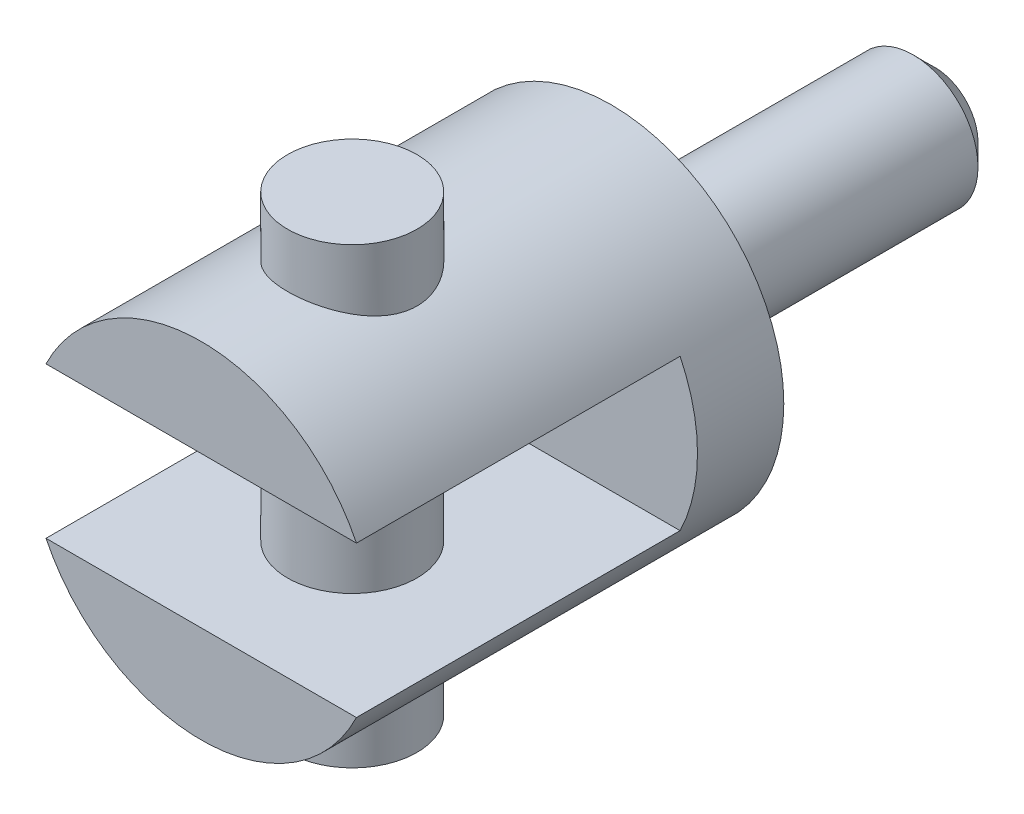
ISO-10303-21;
HEADER;
FILE_DESCRIPTION(('STEP AP214'),'2;1');
FILE_NAME('part.step','',(''),(''),'','','');
FILE_SCHEMA(('AUTOMOTIVE_DESIGN { 1 0 10303 214 1 1 1 1 }'));
ENDSEC;
DATA;
#1=APPLICATION_CONTEXT('core data for automotive mechanical design processes');
#2=APPLICATION_PROTOCOL_DEFINITION('international standard','automotive_design',2000,#1);
#3=PRODUCT_CONTEXT('',#1,'mechanical');
#4=PRODUCT('Part','Part','',(#3));
#5=PRODUCT_RELATED_PRODUCT_CATEGORY('part','',(#4));
#6=PRODUCT_DEFINITION_FORMATION('','',#4);
#7=PRODUCT_DEFINITION_CONTEXT('part definition',#1,'design');
#8=PRODUCT_DEFINITION('design','',#6,#7);
#9=PRODUCT_DEFINITION_SHAPE('','',#8);
#10=(LENGTH_UNIT() NAMED_UNIT(*) SI_UNIT(.MILLI.,.METRE.));
#11=(NAMED_UNIT(*) PLANE_ANGLE_UNIT() SI_UNIT($,.RADIAN.));
#12=(NAMED_UNIT(*) SI_UNIT($,.STERADIAN.) SOLID_ANGLE_UNIT());
#13=UNCERTAINTY_MEASURE_WITH_UNIT(LENGTH_MEASURE(1.E-05),#10,'distance_accuracy_value','');
#14=(GEOMETRIC_REPRESENTATION_CONTEXT(3) GLOBAL_UNCERTAINTY_ASSIGNED_CONTEXT((#13)) GLOBAL_UNIT_ASSIGNED_CONTEXT((#10,
#11,#12)) REPRESENTATION_CONTEXT('',''));
#15=CARTESIAN_POINT('',(0.,0.,0.));
#16=DIRECTION('',(0.,0.,1.));
#17=DIRECTION('',(1.,0.,0.));
#18=AXIS2_PLACEMENT_3D('',#15,#16,#17);
#19=CARTESIAN_POINT('',(0.,0.,19.));
#20=DIRECTION('',(0.,0.,1.));
#21=DIRECTION('',(1.,0.,0.));
#22=AXIS2_PLACEMENT_3D('',#19,#20,#21);
#23=PLANE('',#22);
#24=DIRECTION('',(1.,0.,0.));
#25=VECTOR('',#24,1.);
#26=CARTESIAN_POINT('',(0.,-3.5,19.));
#27=LINE('',#26,#25);
#28=CARTESIAN_POINT('',(-7.19374728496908,-3.5,19.));
#29=VERTEX_POINT('',#28);
#30=CARTESIAN_POINT('',(7.19374728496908,-3.5,19.));
#31=VERTEX_POINT('',#30);
#32=EDGE_CURVE('E37',#29,#31,#27,.T.);
#33=ORIENTED_EDGE('',*,*,#32,.F.);
#34=CARTESIAN_POINT('',(0.,0.,19.));
#35=DIRECTION('',(0.,0.,1.));
#36=DIRECTION('',(1.,0.,0.));
#37=AXIS2_PLACEMENT_3D('',#34,#35,#36);
#38=CIRCLE('',#37,8.);
#39=EDGE_CURVE('E86',#29,#31,#38,.T.);
#40=ORIENTED_EDGE('',*,*,#39,.T.);
#41=EDGE_LOOP('',(#33,#40));
#42=FACE_BOUND('',#41,.T.);
#43=ADVANCED_FACE('F14',(#42),#23,.T.);
#44=DIRECTION('',(-1.,0.,0.));
#45=VECTOR('',#44,1.);
#46=CARTESIAN_POINT('',(0.,3.5,19.));
#47=LINE('',#46,#45);
#48=CARTESIAN_POINT('',(7.19374728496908,3.5,19.));
#49=VERTEX_POINT('',#48);
#50=CARTESIAN_POINT('',(-7.19374728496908,3.5,19.));
#51=VERTEX_POINT('',#50);
#52=EDGE_CURVE('E56',#49,#51,#47,.T.);
#53=ORIENTED_EDGE('',*,*,#52,.F.);
#54=EDGE_CURVE('E85',#49,#51,#38,.T.);
#55=ORIENTED_EDGE('',*,*,#54,.T.);
#56=EDGE_LOOP('',(#53,#55));
#57=FACE_BOUND('',#56,.T.);
#58=ADVANCED_FACE('F150',(#57),#23,.T.);
#59=CARTESIAN_POINT('',(0.,0.,30.));
#60=DIRECTION('',(0.,0.,1.));
#61=DIRECTION('',(1.,0.,0.));
#62=AXIS2_PLACEMENT_3D('',#59,#60,#61);
#63=CYLINDRICAL_SURFACE('',#62,8.);
#64=CARTESIAN_POINT('',(0.,8.,9.));
#65=CARTESIAN_POINT('',(-0.162470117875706,8.00000434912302,8.99999419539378));
#66=CARTESIAN_POINT('',(-0.324900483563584,7.99500758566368,9.01323952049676));
#67=CARTESIAN_POINT('',(-0.644906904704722,7.97557392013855,9.06565639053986));
#68=CARTESIAN_POINT('',(-0.802483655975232,7.96113837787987,9.10482420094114));
#69=CARTESIAN_POINT('',(-1.10812156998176,7.92437664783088,9.20750600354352));
#70=CARTESIAN_POINT('',(-1.25620044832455,7.90206568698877,9.27097303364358));
#71=CARTESIAN_POINT('',(-1.53959862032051,7.85177535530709,9.42021282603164));
#72=CARTESIAN_POINT('',(-1.67491447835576,7.82379446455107,9.5059915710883));
#73=CARTESIAN_POINT('',(-1.93469283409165,7.76372493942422,9.70122506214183));
#74=CARTESIAN_POINT('',(-2.05854146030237,7.73152005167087,9.81146052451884));
#75=CARTESIAN_POINT('',(-2.28648842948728,7.66720441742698,10.0508208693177));
#76=CARTESIAN_POINT('',(-2.39058072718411,7.63509370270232,10.1799515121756));
#77=CARTESIAN_POINT('',(-2.57996404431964,7.5732494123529,10.4594349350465));
#78=CARTESIAN_POINT('',(-2.66438786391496,7.5436529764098,10.6104087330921));
#79=CARTESIAN_POINT('',(-2.80637292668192,7.49199720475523,10.9256967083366));
#80=CARTESIAN_POINT('',(-2.86394489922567,7.46993485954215,11.0900055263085));
#81=CARTESIAN_POINT('',(-2.94816862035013,7.43708825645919,11.4202334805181));
#82=CARTESIAN_POINT('',(-2.97599186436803,7.42587848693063,11.585810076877));
#83=CARTESIAN_POINT('',(-3.00359113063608,7.41476122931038,11.9196323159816));
#84=CARTESIAN_POINT('',(-3.00337873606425,7.41484907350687,12.0878768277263));
#85=CARTESIAN_POINT('',(-2.97580859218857,7.42595023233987,12.4115390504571));
#86=CARTESIAN_POINT('',(-2.95007617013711,7.43630937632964,12.5671218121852));
#87=CARTESIAN_POINT('',(-2.87488335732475,7.46569876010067,12.8715743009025));
#88=CARTESIAN_POINT('',(-2.82541939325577,7.48473030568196,13.020443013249));
#89=CARTESIAN_POINT('',(-2.70327497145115,7.52971404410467,13.3105541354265));
#90=CARTESIAN_POINT('',(-2.63017297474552,7.55579035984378,13.4515989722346));
#91=CARTESIAN_POINT('',(-2.46312147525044,7.61188420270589,13.71989147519));
#92=CARTESIAN_POINT('',(-2.36916477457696,7.64190308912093,13.8471343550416));
#93=CARTESIAN_POINT('',(-2.15563561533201,7.70496077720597,14.0932073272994));
#94=CARTESIAN_POINT('',(-2.03476597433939,7.73806694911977,14.2108972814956));
#95=CARTESIAN_POINT('',(-1.77462518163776,7.80183456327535,14.4246759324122));
#96=CARTESIAN_POINT('',(-1.63535120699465,7.83249562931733,14.5207613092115));
#97=CARTESIAN_POINT('',(-1.33944687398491,7.88852789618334,14.6898607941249));
#98=CARTESIAN_POINT('',(-1.18258142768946,7.91380996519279,14.7624951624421));
#99=CARTESIAN_POINT('',(-0.857673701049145,7.95557436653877,14.8799652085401));
#100=CARTESIAN_POINT('',(-0.689636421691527,7.97206060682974,14.9248132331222));
#101=CARTESIAN_POINT('',(-0.356750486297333,7.99368886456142,14.9832455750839));
#102=CARTESIAN_POINT('',(-0.192207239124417,7.99938738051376,14.998365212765));
#103=CARTESIAN_POINT('',(0.137144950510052,8.00051787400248,15.0013821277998));
#104=CARTESIAN_POINT('',(0.301953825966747,7.99595212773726,14.9892854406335));
#105=CARTESIAN_POINT('',(0.62052409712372,7.97743419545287,14.9393799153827));
#106=CARTESIAN_POINT('',(0.774466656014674,7.9638494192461,14.9025769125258));
#107=CARTESIAN_POINT('',(1.07388350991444,7.92902954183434,14.8056278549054));
#108=CARTESIAN_POINT('',(1.21935670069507,7.9077934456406,14.7454787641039));
#109=CARTESIAN_POINT('',(1.50249553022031,7.85899248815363,14.601627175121));
#110=CARTESIAN_POINT('',(1.63980616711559,7.83126000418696,14.5172845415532));
#111=CARTESIAN_POINT('',(1.89878542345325,7.77253343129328,14.3281637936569));
#112=CARTESIAN_POINT('',(2.0204482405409,7.74153814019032,14.2233781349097));
#113=CARTESIAN_POINT('',(2.25206159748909,7.67746658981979,13.9891917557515));
#114=CARTESIAN_POINT('',(2.36092308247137,7.64437393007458,13.8587156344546));
#115=CARTESIAN_POINT('',(2.55542100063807,7.58157631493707,13.5806972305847));
#116=CARTESIAN_POINT('',(2.64105534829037,7.55187166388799,13.433153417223));
#117=CARTESIAN_POINT('',(2.78675547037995,7.49933659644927,13.1239680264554));
#118=CARTESIAN_POINT('',(2.84671370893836,7.47653520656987,12.9622705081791));
#119=CARTESIAN_POINT('',(2.93815766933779,7.4410806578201,12.6299804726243));
#120=CARTESIAN_POINT('',(2.9696610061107,7.42842122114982,12.4593935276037));
#121=CARTESIAN_POINT('',(3.00172694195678,7.41551789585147,12.1259676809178));
#122=CARTESIAN_POINT('',(3.00414662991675,7.41452889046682,11.9633347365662));
#123=CARTESIAN_POINT('',(2.98273431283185,7.42316825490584,11.6401093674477));
#124=CARTESIAN_POINT('',(2.95890479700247,7.43279561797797,11.4795167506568));
#125=CARTESIAN_POINT('',(2.88711631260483,7.46096283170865,11.1699055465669));
#126=CARTESIAN_POINT('',(2.83991596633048,7.47922170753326,11.0206833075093));
#127=CARTESIAN_POINT('',(2.72339393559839,7.5224309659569,10.7321889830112));
#128=CARTESIAN_POINT('',(2.65406665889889,7.5473830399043,10.5929194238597));
#129=CARTESIAN_POINT('',(2.49104151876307,7.60279447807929,10.3203464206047));
#130=CARTESIAN_POINT('',(2.3962566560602,7.63347396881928,10.1877384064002));
#131=CARTESIAN_POINT('',(2.18668971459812,7.69612493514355,9.93971687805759));
#132=CARTESIAN_POINT('',(2.07190128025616,7.72809681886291,9.82430885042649));
#133=CARTESIAN_POINT('',(1.81816079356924,7.79180849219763,9.60759608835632));
#134=CARTESIAN_POINT('',(1.67823728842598,7.82344209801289,9.50739249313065));
#135=CARTESIAN_POINT('',(1.38242644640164,7.88109028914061,9.33195468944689));
#136=CARTESIAN_POINT('',(1.22653786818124,7.90710443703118,9.25672242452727));
#137=CARTESIAN_POINT('',(0.895998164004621,7.9514858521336,9.13124634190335));
#138=CARTESIAN_POINT('',(0.720826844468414,7.96947314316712,9.08222587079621));
#139=CARTESIAN_POINT('',(0.363751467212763,7.99372484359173,9.01661408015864));
#140=CARTESIAN_POINT('',(0.181850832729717,7.99999513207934,9.00000649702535));
#141=CARTESIAN_POINT('',(0.,8.,9.));
#142=B_SPLINE_CURVE_WITH_KNOTS('',3,(#64,#65,#66,#67,#68,#69,#70,#71,#72,#73,#74,#75,#76,#77,
#78,#79,#80,#81,#82,#83,#84,#85,#86,#87,#88,#89,#90,#91,#92,#93,#94,#95,#96,#97,#98,#99,#100,
#101,#102,#103,#104,#105,#106,#107,#108,#109,#110,#111,#112,#113,#114,#115,#116,#117,#118,#119,
#120,#121,#122,#123,#124,#125,#126,#127,#128,#129,#130,#131,#132,#133,#134,#135,#136,#137,#138,
#139,#140,#141),.UNSPECIFIED.,.T.,.F.,(4,2,2,2,2,2,2,2,2,2,2,2,2,2,2,2,2,2,2,2,2,2,2,2,2,2,2,2,
2,2,2,2,2,2,2,2,2,2,4),(0.,0.486739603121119,0.973409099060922,1.45914273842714,
1.94500675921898,2.44947237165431,2.95409209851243,3.47793349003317,4.00156538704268,
4.50371748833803,5.00566212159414,5.47756690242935,5.94954276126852,6.4304481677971,
6.91151981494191,7.42492306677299,7.93840515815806,8.45982750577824,8.98101799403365,
9.47450039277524,9.96787336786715,10.4422887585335,10.9167658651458,11.4051844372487,
11.8937836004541,12.4107303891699,12.9277235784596,13.4468613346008,13.9656774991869,
14.4511752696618,14.9366270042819,15.4072628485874,15.8780177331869,16.3734494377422,
16.869038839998,17.3914465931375,17.9138949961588,18.4589703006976,19.0037720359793),.UNSPECIFIED.);
#143=CARTESIAN_POINT('',(0.,8.,9.));
#144=VERTEX_POINT('',#143);
#145=EDGE_CURVE('E98',#144,#144,#142,.T.);
#146=ORIENTED_EDGE('',*,*,#145,.F.);
#147=EDGE_LOOP('',(#146));
#148=FACE_BOUND('',#147,.T.);
#149=CARTESIAN_POINT('',(0.,-8.,9.));
#150=CARTESIAN_POINT('',(0.162470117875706,-8.00000434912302,8.99999419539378));
#151=CARTESIAN_POINT('',(0.324900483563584,-7.99500758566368,9.01323952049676));
#152=CARTESIAN_POINT('',(0.644906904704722,-7.97557392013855,9.06565639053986));
#153=CARTESIAN_POINT('',(0.802483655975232,-7.96113837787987,9.10482420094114));
#154=CARTESIAN_POINT('',(1.10812156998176,-7.92437664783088,9.20750600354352));
#155=CARTESIAN_POINT('',(1.25620044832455,-7.90206568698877,9.27097303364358));
#156=CARTESIAN_POINT('',(1.53959862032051,-7.85177535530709,9.42021282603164));
#157=CARTESIAN_POINT('',(1.67491447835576,-7.82379446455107,9.5059915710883));
#158=CARTESIAN_POINT('',(1.93469283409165,-7.76372493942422,9.70122506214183));
#159=CARTESIAN_POINT('',(2.05854146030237,-7.73152005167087,9.81146052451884));
#160=CARTESIAN_POINT('',(2.28648842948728,-7.66720441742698,10.0508208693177));
#161=CARTESIAN_POINT('',(2.39058072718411,-7.63509370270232,10.1799515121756));
#162=CARTESIAN_POINT('',(2.57996404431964,-7.5732494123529,10.4594349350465));
#163=CARTESIAN_POINT('',(2.66438786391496,-7.5436529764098,10.6104087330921));
#164=CARTESIAN_POINT('',(2.80637292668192,-7.49199720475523,10.9256967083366));
#165=CARTESIAN_POINT('',(2.86394489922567,-7.46993485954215,11.0900055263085));
#166=CARTESIAN_POINT('',(2.94816862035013,-7.43708825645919,11.4202334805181));
#167=CARTESIAN_POINT('',(2.97599186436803,-7.42587848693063,11.585810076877));
#168=CARTESIAN_POINT('',(3.00359113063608,-7.41476122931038,11.9196323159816));
#169=CARTESIAN_POINT('',(3.00337873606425,-7.41484907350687,12.0878768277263));
#170=CARTESIAN_POINT('',(2.97580859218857,-7.42595023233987,12.4115390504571));
#171=CARTESIAN_POINT('',(2.95007617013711,-7.43630937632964,12.5671218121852));
#172=CARTESIAN_POINT('',(2.87488335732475,-7.46569876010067,12.8715743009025));
#173=CARTESIAN_POINT('',(2.82541939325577,-7.48473030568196,13.020443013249));
#174=CARTESIAN_POINT('',(2.70327497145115,-7.52971404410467,13.3105541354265));
#175=CARTESIAN_POINT('',(2.63017297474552,-7.55579035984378,13.4515989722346));
#176=CARTESIAN_POINT('',(2.46312147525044,-7.61188420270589,13.71989147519));
#177=CARTESIAN_POINT('',(2.36916477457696,-7.64190308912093,13.8471343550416));
#178=CARTESIAN_POINT('',(2.15563561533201,-7.70496077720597,14.0932073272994));
#179=CARTESIAN_POINT('',(2.03476597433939,-7.73806694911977,14.2108972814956));
#180=CARTESIAN_POINT('',(1.77462518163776,-7.80183456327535,14.4246759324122));
#181=CARTESIAN_POINT('',(1.63535120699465,-7.83249562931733,14.5207613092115));
#182=CARTESIAN_POINT('',(1.33944687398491,-7.88852789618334,14.6898607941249));
#183=CARTESIAN_POINT('',(1.18258142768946,-7.91380996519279,14.7624951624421));
#184=CARTESIAN_POINT('',(0.857673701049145,-7.95557436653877,14.8799652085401));
#185=CARTESIAN_POINT('',(0.689636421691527,-7.97206060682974,14.9248132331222));
#186=CARTESIAN_POINT('',(0.356750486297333,-7.99368886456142,14.9832455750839));
#187=CARTESIAN_POINT('',(0.192207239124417,-7.99938738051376,14.998365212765));
#188=CARTESIAN_POINT('',(-0.137144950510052,-8.00051787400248,15.0013821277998));
#189=CARTESIAN_POINT('',(-0.301953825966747,-7.99595212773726,14.9892854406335));
#190=CARTESIAN_POINT('',(-0.62052409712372,-7.97743419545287,14.9393799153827));
#191=CARTESIAN_POINT('',(-0.774466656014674,-7.9638494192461,14.9025769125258));
#192=CARTESIAN_POINT('',(-1.07388350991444,-7.92902954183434,14.8056278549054));
#193=CARTESIAN_POINT('',(-1.21935670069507,-7.9077934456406,14.7454787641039));
#194=CARTESIAN_POINT('',(-1.50249553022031,-7.85899248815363,14.601627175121));
#195=CARTESIAN_POINT('',(-1.63980616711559,-7.83126000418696,14.5172845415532));
#196=CARTESIAN_POINT('',(-1.89878542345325,-7.77253343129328,14.3281637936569));
#197=CARTESIAN_POINT('',(-2.0204482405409,-7.74153814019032,14.2233781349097));
#198=CARTESIAN_POINT('',(-2.25206159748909,-7.67746658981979,13.9891917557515));
#199=CARTESIAN_POINT('',(-2.36092308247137,-7.64437393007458,13.8587156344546));
#200=CARTESIAN_POINT('',(-2.55542100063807,-7.58157631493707,13.5806972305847));
#201=CARTESIAN_POINT('',(-2.64105534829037,-7.55187166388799,13.433153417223));
#202=CARTESIAN_POINT('',(-2.78675547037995,-7.49933659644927,13.1239680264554));
#203=CARTESIAN_POINT('',(-2.84671370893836,-7.47653520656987,12.9622705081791));
#204=CARTESIAN_POINT('',(-2.93815766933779,-7.4410806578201,12.6299804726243));
#205=CARTESIAN_POINT('',(-2.9696610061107,-7.42842122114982,12.4593935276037));
#206=CARTESIAN_POINT('',(-3.00172694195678,-7.41551789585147,12.1259676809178));
#207=CARTESIAN_POINT('',(-3.00414662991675,-7.41452889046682,11.9633347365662));
#208=CARTESIAN_POINT('',(-2.98273431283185,-7.42316825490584,11.6401093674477));
#209=CARTESIAN_POINT('',(-2.95890479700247,-7.43279561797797,11.4795167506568));
#210=CARTESIAN_POINT('',(-2.88711631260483,-7.46096283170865,11.1699055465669));
#211=CARTESIAN_POINT('',(-2.83991596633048,-7.47922170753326,11.0206833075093));
#212=CARTESIAN_POINT('',(-2.72339393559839,-7.5224309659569,10.7321889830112));
#213=CARTESIAN_POINT('',(-2.65406665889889,-7.5473830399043,10.5929194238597));
#214=CARTESIAN_POINT('',(-2.49104151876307,-7.60279447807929,10.3203464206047));
#215=CARTESIAN_POINT('',(-2.3962566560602,-7.63347396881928,10.1877384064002));
#216=CARTESIAN_POINT('',(-2.18668971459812,-7.69612493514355,9.93971687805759));
#217=CARTESIAN_POINT('',(-2.07190128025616,-7.72809681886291,9.82430885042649));
#218=CARTESIAN_POINT('',(-1.81816079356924,-7.79180849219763,9.60759608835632));
#219=CARTESIAN_POINT('',(-1.67823728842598,-7.82344209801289,9.50739249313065));
#220=CARTESIAN_POINT('',(-1.38242644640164,-7.88109028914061,9.33195468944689));
#221=CARTESIAN_POINT('',(-1.22653786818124,-7.90710443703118,9.25672242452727));
#222=CARTESIAN_POINT('',(-0.895998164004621,-7.9514858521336,9.13124634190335));
#223=CARTESIAN_POINT('',(-0.720826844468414,-7.96947314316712,9.08222587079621));
#224=CARTESIAN_POINT('',(-0.363751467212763,-7.99372484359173,9.01661408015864));
#225=CARTESIAN_POINT('',(-0.181850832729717,-7.99999513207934,9.00000649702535));
#226=CARTESIAN_POINT('',(0.,-8.,9.));
#227=B_SPLINE_CURVE_WITH_KNOTS('',3,(#149,#150,#151,#152,#153,#154,#155,#156,#157,#158,#159,
#160,#161,#162,#163,#164,#165,#166,#167,#168,#169,#170,#171,#172,#173,#174,#175,#176,#177,#178,
#179,#180,#181,#182,#183,#184,#185,#186,#187,#188,#189,#190,#191,#192,#193,#194,#195,#196,#197,
#198,#199,#200,#201,#202,#203,#204,#205,#206,#207,#208,#209,#210,#211,#212,#213,#214,#215,#216,
#217,#218,#219,#220,#221,#222,#223,#224,#225,#226),.UNSPECIFIED.,.T.,.F.,(4,2,2,2,2,2,2,2,2,2,2,
2,2,2,2,2,2,2,2,2,2,2,2,2,2,2,2,2,2,2,2,2,2,2,2,2,2,2,4),(0.,0.486739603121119,
0.973409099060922,1.45914273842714,1.94500675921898,2.44947237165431,2.95409209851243,
3.47793349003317,4.00156538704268,4.50371748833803,5.00566212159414,5.47756690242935,
5.94954276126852,6.4304481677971,6.91151981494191,7.42492306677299,7.93840515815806,
8.45982750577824,8.98101799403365,9.47450039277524,9.96787336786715,10.4422887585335,
10.9167658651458,11.4051844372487,11.8937836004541,12.4107303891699,12.9277235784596,
13.4468613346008,13.9656774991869,14.4511752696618,14.9366270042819,15.4072628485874,
15.8780177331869,16.3734494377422,16.869038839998,17.3914465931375,17.9138949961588,
18.4589703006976,19.0037720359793),.UNSPECIFIED.);
#228=CARTESIAN_POINT('',(0.,-8.,9.));
#229=VERTEX_POINT('',#228);
#230=EDGE_CURVE('E80',#229,#229,#227,.T.);
#231=ORIENTED_EDGE('',*,*,#230,.F.);
#232=EDGE_LOOP('',(#231));
#233=FACE_BOUND('',#232,.T.);
#234=DIRECTION('',(0.,0.,1.));
#235=VECTOR('',#234,1.);
#236=CARTESIAN_POINT('',(-7.19374728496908,-3.5,30.));
#237=LINE('',#236,#235);
#238=CARTESIAN_POINT('',(-7.19374728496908,-3.5,4.));
#239=VERTEX_POINT('',#238);
#240=EDGE_CURVE('E78',#239,#29,#237,.T.);
#241=ORIENTED_EDGE('',*,*,#240,.F.);
#242=CARTESIAN_POINT('',(0.,0.,4.));
#243=DIRECTION('',(0.,0.,-1.));
#244=DIRECTION('',(-1.,0.,0.));
#245=AXIS2_PLACEMENT_3D('',#242,#243,#244);
#246=CIRCLE('',#245,8.);
#247=CARTESIAN_POINT('',(-7.19374728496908,3.5,4.));
#248=VERTEX_POINT('',#247);
#249=EDGE_CURVE('E61',#248,#239,#246,.F.);
#250=ORIENTED_EDGE('',*,*,#249,.F.);
#251=DIRECTION('',(0.,0.,1.));
#252=VECTOR('',#251,1.);
#253=CARTESIAN_POINT('',(-7.19374728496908,3.5,30.));
#254=LINE('',#253,#252);
#255=EDGE_CURVE('E53',#51,#248,#254,.F.);
#256=ORIENTED_EDGE('',*,*,#255,.F.);
#257=ORIENTED_EDGE('',*,*,#54,.F.);
#258=DIRECTION('',(0.,0.,1.));
#259=VECTOR('',#258,1.);
#260=CARTESIAN_POINT('',(7.19374728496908,3.5,30.));
#261=LINE('',#260,#259);
#262=CARTESIAN_POINT('',(7.19374728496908,3.5,4.));
#263=VERTEX_POINT('',#262);
#264=EDGE_CURVE('E84',#263,#49,#261,.T.);
#265=ORIENTED_EDGE('',*,*,#264,.F.);
#266=CARTESIAN_POINT('',(7.19374728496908,-3.5,4.));
#267=VERTEX_POINT('',#266);
#268=EDGE_CURVE('E69',#267,#263,#246,.F.);
#269=ORIENTED_EDGE('',*,*,#268,.F.);
#270=DIRECTION('',(0.,0.,1.));
#271=VECTOR('',#270,1.);
#272=CARTESIAN_POINT('',(7.19374728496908,-3.5,30.));
#273=LINE('',#272,#271);
#274=EDGE_CURVE('E62',#31,#267,#273,.F.);
#275=ORIENTED_EDGE('',*,*,#274,.F.);
#276=ORIENTED_EDGE('',*,*,#39,.F.);
#277=EDGE_LOOP('',(#241,#250,#256,#257,#265,#269,#275,#276));
#278=FACE_BOUND('',#277,.T.);
#279=CARTESIAN_POINT('',(0.,0.,0.));
#280=DIRECTION('',(0.,0.,1.));
#281=DIRECTION('',(1.,0.,0.));
#282=AXIS2_PLACEMENT_3D('',#279,#280,#281);
#283=CIRCLE('',#282,8.);
#284=CARTESIAN_POINT('',(8.,0.,0.));
#285=VERTEX_POINT('',#284);
#286=EDGE_CURVE('E89',#285,#285,#283,.T.);
#287=ORIENTED_EDGE('',*,*,#286,.T.);
#288=EDGE_LOOP('',(#287));
#289=FACE_BOUND('',#288,.T.);
#290=ADVANCED_FACE('F75',(#148,#233,#278,#289),#63,.T.);
#291=CARTESIAN_POINT('',(8.,0.,0.));
#292=DIRECTION('',(0.,0.,-1.));
#293=DIRECTION('',(-1.,0.,0.));
#294=AXIS2_PLACEMENT_3D('',#291,#292,#293);
#295=PLANE('',#294);
#296=CARTESIAN_POINT('',(0.,0.,0.));
#297=DIRECTION('',(0.,0.,1.));
#298=DIRECTION('',(1.,0.,0.));
#299=AXIS2_PLACEMENT_3D('',#296,#297,#298);
#300=CIRCLE('',#299,3.);
#301=CARTESIAN_POINT('',(3.,0.,0.));
#302=VERTEX_POINT('',#301);
#303=EDGE_CURVE('E92',#302,#302,#300,.T.);
#304=ORIENTED_EDGE('',*,*,#303,.T.);
#305=EDGE_LOOP('',(#304));
#306=FACE_BOUND('',#305,.T.);
#307=ORIENTED_EDGE('',*,*,#286,.F.);
#308=EDGE_LOOP('',(#307));
#309=FACE_BOUND('',#308,.T.);
#310=ADVANCED_FACE('F141',(#306,#309),#295,.T.);
#311=CARTESIAN_POINT('',(0.,0.,30.));
#312=DIRECTION('',(0.,0.,1.));
#313=DIRECTION('',(1.,0.,0.));
#314=AXIS2_PLACEMENT_3D('',#311,#312,#313);
#315=CYLINDRICAL_SURFACE('',#314,3.);
#316=CARTESIAN_POINT('',(0.,0.,-14.));
#317=DIRECTION('',(0.,0.,-1.));
#318=DIRECTION('',(-1.,0.,0.));
#319=AXIS2_PLACEMENT_3D('',#316,#317,#318);
#320=CIRCLE('',#319,3.);
#321=CARTESIAN_POINT('',(-3.,0.,-14.));
#322=VERTEX_POINT('',#321);
#323=EDGE_CURVE('E22',#322,#322,#320,.F.);
#324=ORIENTED_EDGE('',*,*,#323,.T.);
#325=EDGE_LOOP('',(#324));
#326=FACE_BOUND('',#325,.T.);
#327=ORIENTED_EDGE('',*,*,#303,.F.);
#328=EDGE_LOOP('',(#327));
#329=FACE_BOUND('',#328,.T.);
#330=ADVANCED_FACE('F138',(#326,#329),#315,.T.);
#331=CARTESIAN_POINT('',(3.,0.,-15.));
#332=DIRECTION('',(0.,0.,-1.));
#333=DIRECTION('',(-1.,0.,0.));
#334=AXIS2_PLACEMENT_3D('',#331,#332,#333);
#335=PLANE('',#334);
#336=CARTESIAN_POINT('',(0.,0.,-15.));
#337=DIRECTION('',(0.,0.,-1.));
#338=DIRECTION('',(-1.,0.,0.));
#339=AXIS2_PLACEMENT_3D('',#336,#337,#338);
#340=CIRCLE('',#339,2.);
#341=CARTESIAN_POINT('',(-2.,0.,-15.));
#342=VERTEX_POINT('',#341);
#343=EDGE_CURVE('E9',#342,#342,#340,.T.);
#344=ORIENTED_EDGE('',*,*,#343,.T.);
#345=EDGE_LOOP('',(#344));
#346=FACE_BOUND('',#345,.T.);
#347=ADVANCED_FACE('F129',(#346),#335,.T.);
#348=CARTESIAN_POINT('',(-10.,-3.5,4.));
#349=DIRECTION('',(0.,0.,-1.));
#350=DIRECTION('',(-1.,0.,0.));
#351=AXIS2_PLACEMENT_3D('',#348,#349,#350);
#352=PLANE('',#351);
#353=ORIENTED_EDGE('',*,*,#268,.T.);
#354=DIRECTION('',(1.,0.,0.));
#355=VECTOR('',#354,1.);
#356=CARTESIAN_POINT('',(-10.,3.5,4.));
#357=LINE('',#356,#355);
#358=EDGE_CURVE('E29',#248,#263,#357,.T.);
#359=ORIENTED_EDGE('',*,*,#358,.F.);
#360=ORIENTED_EDGE('',*,*,#249,.T.);
#361=DIRECTION('',(1.,0.,0.));
#362=VECTOR('',#361,1.);
#363=CARTESIAN_POINT('',(-10.,-3.5,4.));
#364=LINE('',#363,#362);
#365=EDGE_CURVE('E71',#239,#267,#364,.T.);
#366=ORIENTED_EDGE('',*,*,#365,.T.);
#367=EDGE_LOOP('',(#353,#359,#360,#366));
#368=FACE_BOUND('',#367,.T.);
#369=ADVANCED_FACE('F65',(#368),#352,.F.);
#370=CARTESIAN_POINT('',(-10.,-3.5,20.));
#371=DIRECTION('',(0.,-1.,0.));
#372=DIRECTION('',(0.,0.,-1.));
#373=AXIS2_PLACEMENT_3D('',#370,#371,#372);
#374=PLANE('',#373);
#375=CARTESIAN_POINT('',(0.,-3.5,12.));
#376=DIRECTION('',(0.,-1.,0.));
#377=DIRECTION('',(0.,0.,-1.));
#378=AXIS2_PLACEMENT_3D('',#375,#376,#377);
#379=CIRCLE('',#378,3.);
#380=CARTESIAN_POINT('',(0.,-3.5,9.));
#381=VERTEX_POINT('',#380);
#382=EDGE_CURVE('E72',#381,#381,#379,.T.);
#383=ORIENTED_EDGE('',*,*,#382,.T.);
#384=EDGE_LOOP('',(#383));
#385=FACE_BOUND('',#384,.T.);
#386=ORIENTED_EDGE('',*,*,#274,.T.);
#387=ORIENTED_EDGE('',*,*,#365,.F.);
#388=ORIENTED_EDGE('',*,*,#240,.T.);
#389=ORIENTED_EDGE('',*,*,#32,.T.);
#390=EDGE_LOOP('',(#386,#387,#388,#389));
#391=FACE_BOUND('',#390,.T.);
#392=ADVANCED_FACE('F128',(#385,#391),#374,.F.);
#393=CARTESIAN_POINT('',(-10.,3.5,4.));
#394=DIRECTION('',(0.,1.,0.));
#395=DIRECTION('',(0.,0.,1.));
#396=AXIS2_PLACEMENT_3D('',#393,#394,#395);
#397=PLANE('',#396);
#398=CARTESIAN_POINT('',(0.,3.5,12.));
#399=DIRECTION('',(0.,1.,0.));
#400=DIRECTION('',(0.,0.,1.));
#401=AXIS2_PLACEMENT_3D('',#398,#399,#400);
#402=CIRCLE('',#401,3.);
#403=CARTESIAN_POINT('',(0.,3.5,15.));
#404=VERTEX_POINT('',#403);
#405=EDGE_CURVE('E262',#404,#404,#402,.T.);
#406=ORIENTED_EDGE('',*,*,#405,.T.);
#407=EDGE_LOOP('',(#406));
#408=FACE_BOUND('',#407,.T.);
#409=ORIENTED_EDGE('',*,*,#255,.T.);
#410=ORIENTED_EDGE('',*,*,#358,.T.);
#411=ORIENTED_EDGE('',*,*,#264,.T.);
#412=ORIENTED_EDGE('',*,*,#52,.T.);
#413=EDGE_LOOP('',(#409,#410,#411,#412));
#414=FACE_BOUND('',#413,.T.);
#415=ADVANCED_FACE('F54',(#408,#414),#397,.F.);
#416=CARTESIAN_POINT('',(0.,-20.,12.));
#417=DIRECTION('',(0.,-1.,0.));
#418=DIRECTION('',(0.,0.,-1.));
#419=AXIS2_PLACEMENT_3D('',#416,#417,#418);
#420=CYLINDRICAL_SURFACE('',#419,3.);
#421=ORIENTED_EDGE('',*,*,#405,.F.);
#422=EDGE_LOOP('',(#421));
#423=FACE_BOUND('',#422,.T.);
#424=ORIENTED_EDGE('',*,*,#382,.F.);
#425=EDGE_LOOP('',(#424));
#426=FACE_BOUND('',#425,.T.);
#427=ADVANCED_FACE('F120',(#423,#426),#420,.T.);
#428=CARTESIAN_POINT('',(0.,-10.5,12.));
#429=DIRECTION('',(0.,-1.,0.));
#430=DIRECTION('',(0.,0.,-1.));
#431=AXIS2_PLACEMENT_3D('',#428,#429,#430);
#432=PLANE('',#431);
#433=CARTESIAN_POINT('',(0.,-10.5,12.));
#434=DIRECTION('',(0.,-1.,0.));
#435=DIRECTION('',(0.,0.,-1.));
#436=AXIS2_PLACEMENT_3D('',#433,#434,#435);
#437=CIRCLE('',#436,3.);
#438=CARTESIAN_POINT('',(0.,-10.5,9.));
#439=VERTEX_POINT('',#438);
#440=EDGE_CURVE('E265',#439,#439,#437,.T.);
#441=ORIENTED_EDGE('',*,*,#440,.T.);
#442=EDGE_LOOP('',(#441));
#443=FACE_BOUND('',#442,.T.);
#444=ADVANCED_FACE('F121',(#443),#432,.T.);
#445=ORIENTED_EDGE('',*,*,#230,.T.);
#446=EDGE_LOOP('',(#445));
#447=FACE_BOUND('',#446,.T.);
#448=ORIENTED_EDGE('',*,*,#440,.F.);
#449=EDGE_LOOP('',(#448));
#450=FACE_BOUND('',#449,.T.);
#451=ADVANCED_FACE('F118',(#447,#450),#420,.T.);
#452=ORIENTED_EDGE('',*,*,#145,.T.);
#453=EDGE_LOOP('',(#452));
#454=FACE_BOUND('',#453,.T.);
#455=CARTESIAN_POINT('',(0.,10.5,12.));
#456=DIRECTION('',(0.,-1.,0.));
#457=DIRECTION('',(0.,0.,-1.));
#458=AXIS2_PLACEMENT_3D('',#455,#456,#457);
#459=CIRCLE('',#458,3.);
#460=CARTESIAN_POINT('',(0.,10.5,9.));
#461=VERTEX_POINT('',#460);
#462=EDGE_CURVE('E270',#461,#461,#459,.T.);
#463=ORIENTED_EDGE('',*,*,#462,.T.);
#464=EDGE_LOOP('',(#463));
#465=FACE_BOUND('',#464,.T.);
#466=ADVANCED_FACE('F112',(#454,#465),#420,.T.);
#467=CARTESIAN_POINT('',(0.,10.5,15.));
#468=DIRECTION('',(0.,1.,0.));
#469=DIRECTION('',(0.,0.,1.));
#470=AXIS2_PLACEMENT_3D('',#467,#468,#469);
#471=PLANE('',#470);
#472=ORIENTED_EDGE('',*,*,#462,.F.);
#473=EDGE_LOOP('',(#472));
#474=FACE_BOUND('',#473,.T.);
#475=ADVANCED_FACE('F117',(#474),#471,.T.);
#476=CARTESIAN_POINT('',(0.,0.,-14.));
#477=DIRECTION('',(0.,0.,1.));
#478=DIRECTION('',(1.,0.,0.));
#479=AXIS2_PLACEMENT_3D('',#476,#477,#478);
#480=CONICAL_SURFACE('',#479,3.,0.78539816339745);
#481=ORIENTED_EDGE('',*,*,#343,.F.);
#482=EDGE_LOOP('',(#481));
#483=FACE_BOUND('',#482,.T.);
#484=ORIENTED_EDGE('',*,*,#323,.F.);
#485=EDGE_LOOP('',(#484));
#486=FACE_BOUND('',#485,.T.);
#487=ADVANCED_FACE('F16',(#483,#486),#480,.T.);
#488=CLOSED_SHELL('',(#43,#58,#290,#310,#330,#347,#369,#392,#415,#427,#444,#451,#466,#475,#487));
#489=MANIFOLD_SOLID_BREP('B1',#488);
#490=ADVANCED_BREP_SHAPE_REPRESENTATION('',(#18,#489),#14);
#491=SHAPE_DEFINITION_REPRESENTATION(#9,#490);
ENDSEC;
END-ISO-10303-21;
